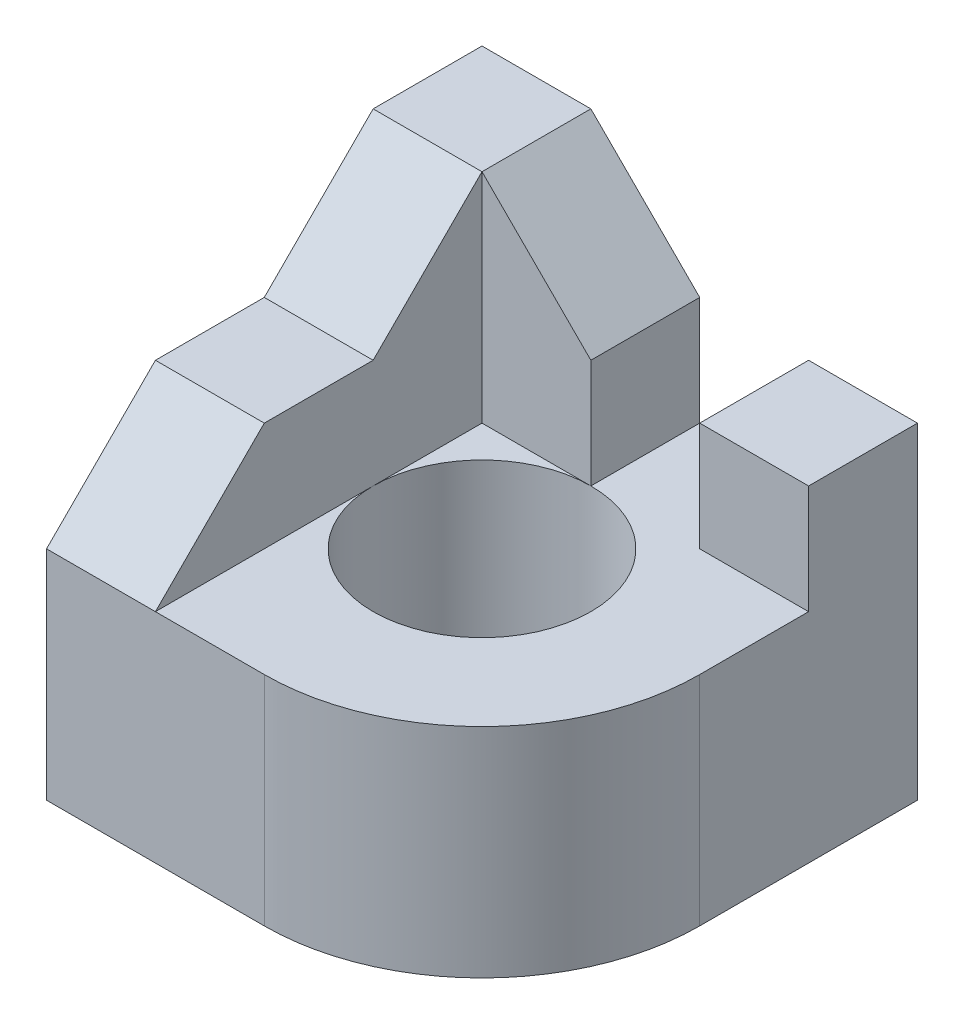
from build123d import *

# Parameters (mm, degrees)
EXTRUDE1_DEPTH = 20
EXTRUDE2_DEPTH = 20
SKETCH_W       = 10
SKETCH_H       = 10
EXTRUDE3_DEPTH = 10
EXTRUDE4_DEPTH = 65.031242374
CHAMFER1_SIZE  = 10
SKETCH5_R      = 10
EXTRUDE5_DEPTH = 61


with BuildPart() as part:
    # Sketch2 → Extrude1 (new body)
    with BuildSketch(Plane(origin=(0, 0, 0), x_dir=(1, 0, 0), z_dir=(0, 1, 0))):
        with BuildLine():
            ThreePointArc((40, -20), (34.142135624, -34.142135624), (20, -40))
            Line((20, -40), (0, -40))
            Line((0, -40), (0, 0))
            Line((0, 0), (40, 0))
            Line((40, 0), (40, -20))
        make_face()
    extrude(amount=EXTRUDE1_DEPTH)

    # Sketch3 → Extrude2 (add)
    with BuildSketch(Plane(origin=(0, 20, 0), x_dir=(1, 0, 0), z_dir=(0, 1, 0))):
        Polygon((0, -40), (10, -40), (10, -10), (20, -10), (20, 0), (0, 0), align=None)
    extrude(amount=EXTRUDE2_DEPTH)

    # Sketch → Extrude3 (add)
    with BuildSketch(Plane(origin=(0, 20, 0), x_dir=(1, 0, 0), z_dir=(0, 1, 0))):
        with Locations((35, -5)):
            Rectangle(SKETCH_W, SKETCH_H)
    extrude(amount=EXTRUDE3_DEPTH)

    # Sketch4 → Extrude4 (cut, through all)
    with BuildSketch(Plane(origin=(10, 0, 0), x_dir=(0, 0, -1), z_dir=(1, 0, 0))):
        Polygon((-10, 40), (-20, 30), (-30, 30), (-40, 20), (-40, 40), align=None)
    extrude(amount=-EXTRUDE4_DEPTH, mode=Mode.SUBTRACT)

    # Chamfer1
    chamfer1_edges = [part.edges().sort_by_distance(p)[0] for p in [
        (20, 40, 5),
    ]]
    chamfer(chamfer1_edges, length=CHAMFER1_SIZE)

    # Sketch5 → Extrude5 (cut, through all)
    with BuildSketch(Plane(origin=(0, 20, 0), x_dir=(1, 0, 0), z_dir=(0, 1, 0))):
        with Locations(Location((20, -20, 0), (0, 0, 270))):
            Circle(SKETCH5_R)
    extrude(amount=-EXTRUDE5_DEPTH, mode=Mode.SUBTRACT)


solid = part.part
